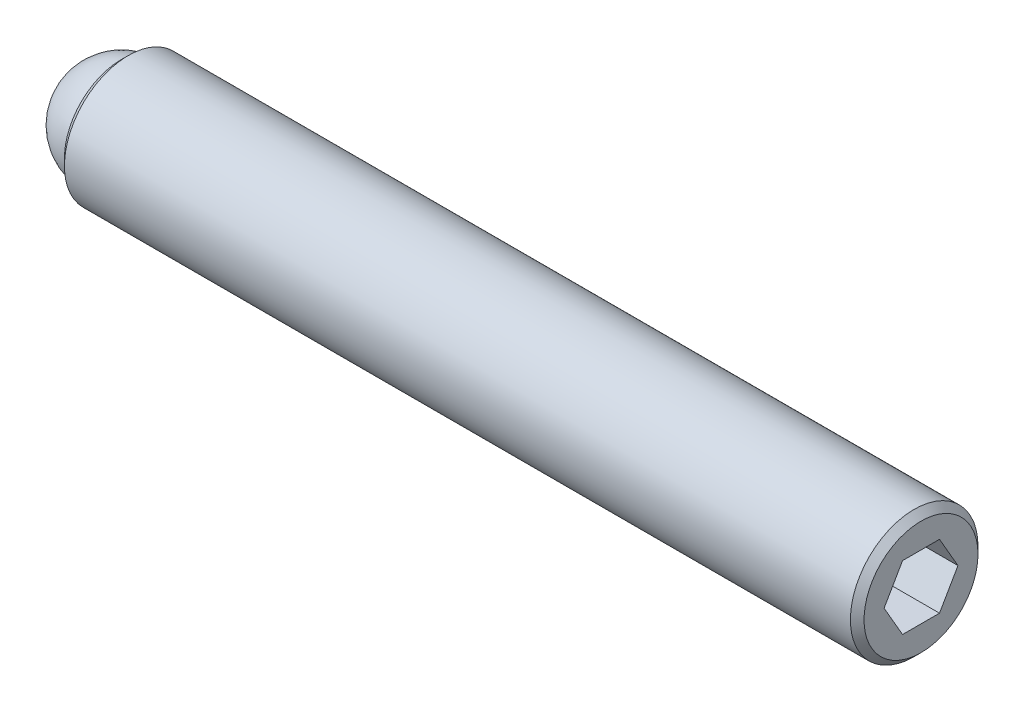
from build123d import *

# Parameters (mm, degrees)
SKETCH2_R           = 2.3749
BOSS_EXTRUDE1_DEPTH = 29.765625
CHAMFER1_SIZE       = 0.254
CHAMFER2_SIZE       = 0.254
CUT_EXTRUDE2_DEPTH  = 2.286
SKETCH3_R           = 1.9812
CUT_EXTRUDE3_DEPTH  = 1.984375


with BuildPart() as part:
    # Sketch2 → Boss-Extrude1 (new body)
    with BuildSketch(Plane(origin=(0, 0, 0), x_dir=(0, 0, -1), z_dir=(1, 0, 0))):
        Circle(SKETCH2_R)
    extrude(amount=BOSS_EXTRUDE1_DEPTH)

    # Chamfer1
    chamfer1_edges = [part.edges().sort_by_distance(p)[0] for p in [
        (0, 0, 2.3749),
    ]]
    chamfer(chamfer1_edges, length=CHAMFER1_SIZE)

    # Chamfer2
    chamfer2_edges = [part.edges().sort_by_distance(p)[0] for p in [
        (29.765625, 0, 2.3749),
    ]]
    chamfer(chamfer2_edges, length=CHAMFER2_SIZE)

    # Sketch4 → Cut-Extrude2 (cut)
    with BuildSketch(Plane(origin=(29.765625, 0, 0), x_dir=(0, 0, -1), z_dir=(1, 0, 0))):
        Polygon((1.374815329, 0), (0.687407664, 1.190625), (-0.687407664, 1.190625), (-1.374815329, 0), (-0.687407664, -1.190625), (0.687407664, -1.190625), align=None)
    extrude(amount=-CUT_EXTRUDE2_DEPTH, mode=Mode.SUBTRACT)

    # Sketch3 → Cut-Extrude3 (cut)
    with BuildSketch(Plane.ZY):
        Circle(SKETCH3_R)
    extrude(amount=-CUT_EXTRUDE3_DEPTH, mode=Mode.SUBTRACT)


with BuildPart() as body_2:
    # Sketch5 → Revolve1 (revolve)
    with BuildSketch(Plane.ZY):
        with BuildLine():
            Line((0, 0), (0, -1.984375))
            ThreePointArc((0, -1.984375), (-1.984375, 0), (0, 1.984375))
            Line((0, 1.984375), (0, 0))
        make_face()
    revolve(axis=Axis((0, 0, 0), (0, 1, 0)))


solid = Compound([part.part, body_2.part])
